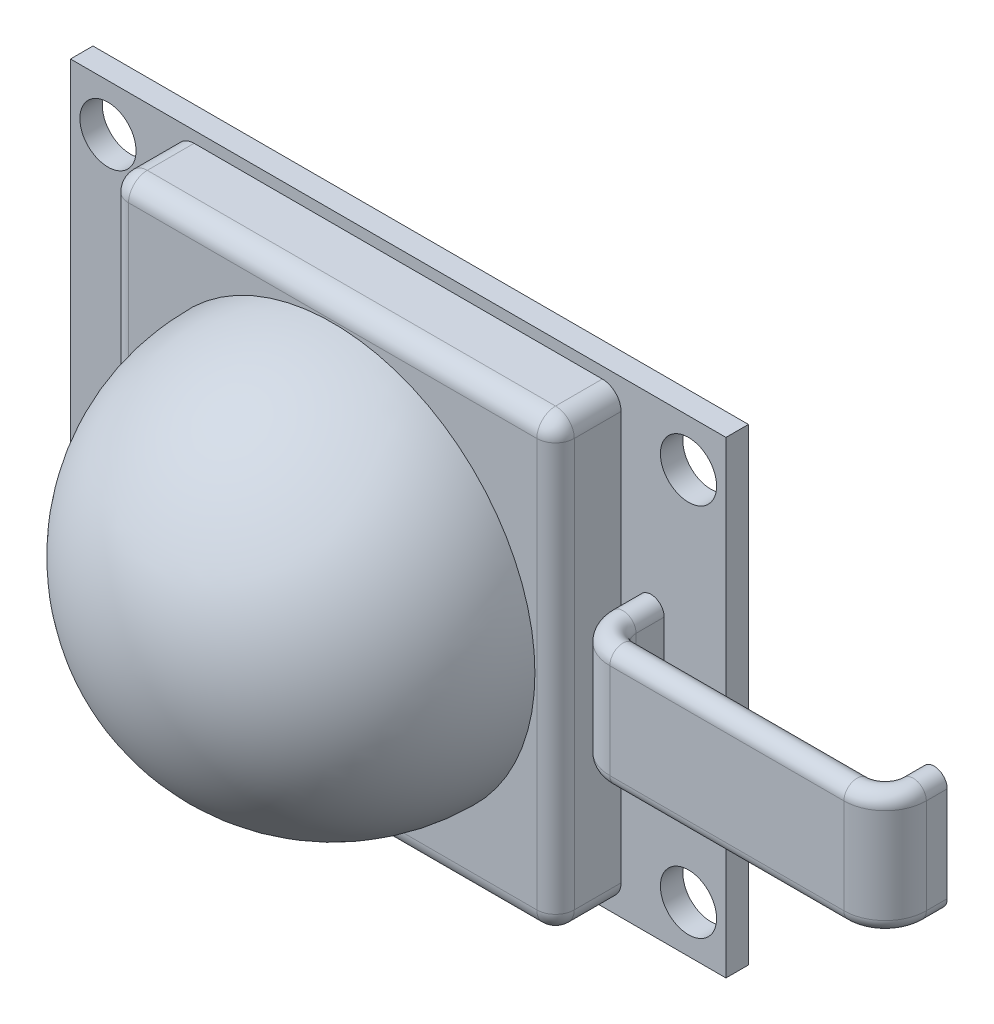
ISO-10303-21;
HEADER;
FILE_DESCRIPTION(('STEP AP214'),'2;1');
FILE_NAME('part.step','',(''),(''),'','','');
FILE_SCHEMA(('AUTOMOTIVE_DESIGN { 1 0 10303 214 1 1 1 1 }'));
ENDSEC;
DATA;
#1=APPLICATION_CONTEXT('core data for automotive mechanical design processes');
#2=APPLICATION_PROTOCOL_DEFINITION('international standard','automotive_design',2000,#1);
#3=PRODUCT_CONTEXT('',#1,'mechanical');
#4=PRODUCT('Part','Part','',(#3));
#5=PRODUCT_RELATED_PRODUCT_CATEGORY('part','',(#4));
#6=PRODUCT_DEFINITION_FORMATION('','',#4);
#7=PRODUCT_DEFINITION_CONTEXT('part definition',#1,'design');
#8=PRODUCT_DEFINITION('design','',#6,#7);
#9=PRODUCT_DEFINITION_SHAPE('','',#8);
#10=(LENGTH_UNIT() NAMED_UNIT(*) SI_UNIT(.MILLI.,.METRE.));
#11=(NAMED_UNIT(*) PLANE_ANGLE_UNIT() SI_UNIT($,.RADIAN.));
#12=(NAMED_UNIT(*) SI_UNIT($,.STERADIAN.) SOLID_ANGLE_UNIT());
#13=UNCERTAINTY_MEASURE_WITH_UNIT(LENGTH_MEASURE(1.E-05),#10,'distance_accuracy_value','');
#14=(GEOMETRIC_REPRESENTATION_CONTEXT(3) GLOBAL_UNCERTAINTY_ASSIGNED_CONTEXT((#13)) GLOBAL_UNIT_ASSIGNED_CONTEXT((#10,
#11,#12)) REPRESENTATION_CONTEXT('',''));
#15=CARTESIAN_POINT('',(0.,0.,0.));
#16=DIRECTION('',(0.,0.,1.));
#17=DIRECTION('',(1.,0.,0.));
#18=AXIS2_PLACEMENT_3D('',#15,#16,#17);
#19=CARTESIAN_POINT('',(0.,25.,1.2));
#20=DIRECTION('',(0.,0.,-1.));
#21=DIRECTION('',(-1.,0.,0.));
#22=AXIS2_PLACEMENT_3D('',#19,#20,#21);
#23=PLANE('',#22);
#24=CARTESIAN_POINT('',(28.4,23.4,1.2));
#25=DIRECTION('',(0.,0.,1.));
#26=DIRECTION('',(-1.,0.,0.));
#27=AXIS2_PLACEMENT_3D('',#24,#25,#26);
#28=CIRCLE('',#27,1.);
#29=CARTESIAN_POINT('',(29.4,23.4,1.2));
#30=VERTEX_POINT('',#29);
#31=CARTESIAN_POINT('',(28.4,24.4,1.2));
#32=VERTEX_POINT('',#31);
#33=EDGE_CURVE('E339',#30,#32,#28,.T.);
#34=ORIENTED_EDGE('',*,*,#33,.F.);
#35=DIRECTION('',(0.,1.,0.));
#36=VECTOR('',#35,1.);
#37=CARTESIAN_POINT('',(29.4,23.4,1.2));
#38=LINE('',#37,#36);
#39=CARTESIAN_POINT('',(29.4,1.60000000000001,1.2));
#40=VERTEX_POINT('',#39);
#41=EDGE_CURVE('E361',#40,#30,#38,.T.);
#42=ORIENTED_EDGE('',*,*,#41,.F.);
#43=CARTESIAN_POINT('',(28.4,1.6,1.2));
#44=DIRECTION('',(0.,0.,1.));
#45=DIRECTION('',(1.,0.,0.));
#46=AXIS2_PLACEMENT_3D('',#43,#44,#45);
#47=CIRCLE('',#46,1.);
#48=CARTESIAN_POINT('',(28.4,0.600000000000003,1.2));
#49=VERTEX_POINT('',#48);
#50=EDGE_CURVE('E358',#49,#40,#47,.T.);
#51=ORIENTED_EDGE('',*,*,#50,.F.);
#52=DIRECTION('',(1.,0.,0.));
#53=VECTOR('',#52,1.);
#54=CARTESIAN_POINT('',(6.60000000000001,0.599999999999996,1.2));
#55=LINE('',#54,#53);
#56=CARTESIAN_POINT('',(6.60000000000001,0.599999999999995,1.2));
#57=VERTEX_POINT('',#56);
#58=EDGE_CURVE('E355',#57,#49,#55,.T.);
#59=ORIENTED_EDGE('',*,*,#58,.F.);
#60=CARTESIAN_POINT('',(6.6,1.6,1.2));
#61=DIRECTION('',(0.,0.,1.));
#62=DIRECTION('',(1.,0.,0.));
#63=AXIS2_PLACEMENT_3D('',#60,#61,#62);
#64=CIRCLE('',#63,1.);
#65=CARTESIAN_POINT('',(5.6,1.6,1.2));
#66=VERTEX_POINT('',#65);
#67=EDGE_CURVE('E352',#66,#57,#64,.T.);
#68=ORIENTED_EDGE('',*,*,#67,.F.);
#69=DIRECTION('',(0.,-1.,0.));
#70=VECTOR('',#69,1.);
#71=CARTESIAN_POINT('',(5.6,23.4,1.2));
#72=LINE('',#71,#70);
#73=CARTESIAN_POINT('',(5.6,23.4,1.2));
#74=VERTEX_POINT('',#73);
#75=EDGE_CURVE('E349',#74,#66,#72,.T.);
#76=ORIENTED_EDGE('',*,*,#75,.F.);
#77=CARTESIAN_POINT('',(6.6,23.4,1.2));
#78=DIRECTION('',(0.,0.,1.));
#79=DIRECTION('',(1.,0.,0.));
#80=AXIS2_PLACEMENT_3D('',#77,#78,#79);
#81=CIRCLE('',#80,1.);
#82=CARTESIAN_POINT('',(6.6,24.4,1.2));
#83=VERTEX_POINT('',#82);
#84=EDGE_CURVE('E346',#83,#74,#81,.T.);
#85=ORIENTED_EDGE('',*,*,#84,.F.);
#86=DIRECTION('',(-1.,0.,0.));
#87=VECTOR('',#86,1.);
#88=CARTESIAN_POINT('',(6.6,24.4,1.2));
#89=LINE('',#88,#87);
#90=EDGE_CURVE('E342',#32,#83,#89,.T.);
#91=ORIENTED_EDGE('',*,*,#90,.F.);
#92=EDGE_LOOP('',(#34,#42,#51,#59,#68,#76,#85,#91));
#93=FACE_BOUND('',#92,.T.);
#94=CARTESIAN_POINT('',(2.,22.5,1.2));
#95=DIRECTION('',(0.,0.,1.));
#96=DIRECTION('',(-1.,0.,0.));
#97=AXIS2_PLACEMENT_3D('',#94,#95,#96);
#98=CIRCLE('',#97,1.5);
#99=CARTESIAN_POINT('',(0.499999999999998,22.5,1.2));
#100=VERTEX_POINT('',#99);
#101=EDGE_CURVE('E397',#100,#100,#98,.T.);
#102=ORIENTED_EDGE('',*,*,#101,.F.);
#103=EDGE_LOOP('',(#102));
#104=FACE_BOUND('',#103,.T.);
#105=CARTESIAN_POINT('',(33.,2.5,1.2));
#106=DIRECTION('',(0.,0.,1.));
#107=DIRECTION('',(-1.,0.,0.));
#108=AXIS2_PLACEMENT_3D('',#105,#106,#107);
#109=CIRCLE('',#108,1.5);
#110=CARTESIAN_POINT('',(31.5,2.5,1.2));
#111=VERTEX_POINT('',#110);
#112=EDGE_CURVE('E409',#111,#111,#109,.T.);
#113=ORIENTED_EDGE('',*,*,#112,.F.);
#114=EDGE_LOOP('',(#113));
#115=FACE_BOUND('',#114,.T.);
#116=DIRECTION('',(0.,-1.,0.));
#117=VECTOR('',#116,1.);
#118=CARTESIAN_POINT('',(0.,0.,1.2));
#119=LINE('',#118,#117);
#120=CARTESIAN_POINT('',(0.,25.,1.2));
#121=VERTEX_POINT('',#120);
#122=CARTESIAN_POINT('',(0.,0.,1.2));
#123=VERTEX_POINT('',#122);
#124=EDGE_CURVE('E421',#121,#123,#119,.T.);
#125=ORIENTED_EDGE('',*,*,#124,.T.);
#126=DIRECTION('',(1.,0.,0.));
#127=VECTOR('',#126,1.);
#128=CARTESIAN_POINT('',(0.,0.,1.2));
#129=LINE('',#128,#127);
#130=CARTESIAN_POINT('',(35.,0.,1.2));
#131=VERTEX_POINT('',#130);
#132=EDGE_CURVE('E424',#123,#131,#129,.T.);
#133=ORIENTED_EDGE('',*,*,#132,.T.);
#134=DIRECTION('',(0.,1.,0.));
#135=VECTOR('',#134,1.);
#136=CARTESIAN_POINT('',(35.,0.,1.2));
#137=LINE('',#136,#135);
#138=CARTESIAN_POINT('',(35.,25.,1.2));
#139=VERTEX_POINT('',#138);
#140=EDGE_CURVE('E427',#131,#139,#137,.T.);
#141=ORIENTED_EDGE('',*,*,#140,.T.);
#142=DIRECTION('',(-1.,0.,0.));
#143=VECTOR('',#142,1.);
#144=CARTESIAN_POINT('',(0.,25.,1.2));
#145=LINE('',#144,#143);
#146=EDGE_CURVE('E429',#139,#121,#145,.T.);
#147=ORIENTED_EDGE('',*,*,#146,.T.);
#148=EDGE_LOOP('',(#125,#133,#141,#147));
#149=FACE_BOUND('',#148,.T.);
#150=CARTESIAN_POINT('',(2.,2.5,1.2));
#151=DIRECTION('',(0.,0.,1.));
#152=DIRECTION('',(1.,0.,0.));
#153=AXIS2_PLACEMENT_3D('',#150,#151,#152);
#154=CIRCLE('',#153,1.5);
#155=CARTESIAN_POINT('',(3.5,2.5,1.2));
#156=VERTEX_POINT('',#155);
#157=EDGE_CURVE('E415',#156,#156,#154,.T.);
#158=ORIENTED_EDGE('',*,*,#157,.F.);
#159=EDGE_LOOP('',(#158));
#160=FACE_BOUND('',#159,.T.);
#161=CARTESIAN_POINT('',(33.,22.5,1.2));
#162=DIRECTION('',(0.,0.,1.));
#163=DIRECTION('',(1.,0.,0.));
#164=AXIS2_PLACEMENT_3D('',#161,#162,#163);
#165=CIRCLE('',#164,1.5);
#166=CARTESIAN_POINT('',(34.5,22.5,1.2));
#167=VERTEX_POINT('',#166);
#168=EDGE_CURVE('E403',#167,#167,#165,.T.);
#169=ORIENTED_EDGE('',*,*,#168,.F.);
#170=EDGE_LOOP('',(#169));
#171=FACE_BOUND('',#170,.T.);
#172=CARTESIAN_POINT('',(31.,15.04,1.2));
#173=DIRECTION('',(0.,0.,1.));
#174=DIRECTION('',(1.,0.,0.));
#175=AXIS2_PLACEMENT_3D('',#172,#173,#174);
#176=CIRCLE('',#175,0.700000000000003);
#177=CARTESIAN_POINT('',(31.7,15.04,1.2));
#178=VERTEX_POINT('',#177);
#179=CARTESIAN_POINT('',(30.3,15.04,1.2));
#180=VERTEX_POINT('',#179);
#181=EDGE_CURVE('E55',#178,#180,#176,.T.);
#182=ORIENTED_EDGE('',*,*,#181,.F.);
#183=DIRECTION('',(0.,1.,0.));
#184=VECTOR('',#183,1.);
#185=CARTESIAN_POINT('',(31.7,15.04,1.2));
#186=LINE('',#185,#184);
#187=CARTESIAN_POINT('',(31.7,9.96,1.2));
#188=VERTEX_POINT('',#187);
#189=EDGE_CURVE('E231',#188,#178,#186,.T.);
#190=ORIENTED_EDGE('',*,*,#189,.F.);
#191=CARTESIAN_POINT('',(31.,9.96,1.2));
#192=DIRECTION('',(0.,0.,1.));
#193=DIRECTION('',(-1.,0.,0.));
#194=AXIS2_PLACEMENT_3D('',#191,#192,#193);
#195=CIRCLE('',#194,0.700000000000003);
#196=CARTESIAN_POINT('',(30.3,9.96,1.2));
#197=VERTEX_POINT('',#196);
#198=EDGE_CURVE('E1147',#197,#188,#195,.T.);
#199=ORIENTED_EDGE('',*,*,#198,.F.);
#200=DIRECTION('',(0.,-1.,0.));
#201=VECTOR('',#200,1.);
#202=CARTESIAN_POINT('',(30.3,15.04,1.2));
#203=LINE('',#202,#201);
#204=EDGE_CURVE('E50',#180,#197,#203,.T.);
#205=ORIENTED_EDGE('',*,*,#204,.F.);
#206=EDGE_LOOP('',(#182,#190,#199,#205));
#207=FACE_BOUND('',#206,.T.);
#208=ADVANCED_FACE('F34',(#93,#104,#115,#149,#160,#171,#207),#23,.F.);
#209=CARTESIAN_POINT('',(28.4,23.4,4.7));
#210=DIRECTION('',(0.,0.,-1.));
#211=DIRECTION('',(-1.,0.,0.));
#212=AXIS2_PLACEMENT_3D('',#209,#210,#211);
#213=PLANE('',#212);
#214=DIRECTION('',(-1.,0.,0.));
#215=VECTOR('',#214,1.);
#216=CARTESIAN_POINT('',(28.4,23.4,4.7));
#217=LINE('',#216,#215);
#218=CARTESIAN_POINT('',(28.4,23.4,4.7));
#219=VERTEX_POINT('',#218);
#220=CARTESIAN_POINT('',(6.6,23.4,4.7));
#221=VERTEX_POINT('',#220);
#222=EDGE_CURVE('E457',#219,#221,#217,.T.);
#223=ORIENTED_EDGE('',*,*,#222,.T.);
#224=DIRECTION('',(0.,-1.,0.));
#225=VECTOR('',#224,1.);
#226=CARTESIAN_POINT('',(6.6,23.4,4.7));
#227=LINE('',#226,#225);
#228=CARTESIAN_POINT('',(6.6,1.6,4.7));
#229=VERTEX_POINT('',#228);
#230=EDGE_CURVE('E459',#221,#229,#227,.T.);
#231=ORIENTED_EDGE('',*,*,#230,.T.);
#232=DIRECTION('',(1.,0.,0.));
#233=VECTOR('',#232,1.);
#234=CARTESIAN_POINT('',(28.4,1.6,4.7));
#235=LINE('',#234,#233);
#236=CARTESIAN_POINT('',(28.4,1.6,4.7));
#237=VERTEX_POINT('',#236);
#238=EDGE_CURVE('E453',#229,#237,#235,.T.);
#239=ORIENTED_EDGE('',*,*,#238,.T.);
#240=DIRECTION('',(0.,1.,0.));
#241=VECTOR('',#240,1.);
#242=CARTESIAN_POINT('',(28.4,23.4,4.7));
#243=LINE('',#242,#241);
#244=EDGE_CURVE('E455',#237,#219,#243,.T.);
#245=ORIENTED_EDGE('',*,*,#244,.T.);
#246=EDGE_LOOP('',(#223,#231,#239,#245));
#247=FACE_BOUND('',#246,.T.);
#248=CARTESIAN_POINT('',(17.5,12.5,4.7));
#249=DIRECTION('',(0.,0.,-1.));
#250=DIRECTION('',(-1.,0.,0.));
#251=AXIS2_PLACEMENT_3D('',#248,#249,#250);
#252=CIRCLE('',#251,10.8001);
#253=CARTESIAN_POINT('',(6.6999,12.5,4.7));
#254=VERTEX_POINT('',#253);
#255=EDGE_CURVE('E11',#254,#254,#252,.F.);
#256=ORIENTED_EDGE('',*,*,#255,.F.);
#257=EDGE_LOOP('',(#256));
#258=FACE_BOUND('',#257,.T.);
#259=ADVANCED_FACE('F567',(#247,#258),#213,.F.);
#260=CARTESIAN_POINT('',(0.,25.,0.));
#261=DIRECTION('',(0.,0.,-1.));
#262=DIRECTION('',(-1.,0.,0.));
#263=AXIS2_PLACEMENT_3D('',#260,#261,#262);
#264=PLANE('',#263);
#265=CARTESIAN_POINT('',(31.,9.96,0.));
#266=DIRECTION('',(0.,0.,1.));
#267=DIRECTION('',(-1.,0.,0.));
#268=AXIS2_PLACEMENT_3D('',#265,#266,#267);
#269=CIRCLE('',#268,0.400000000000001);
#270=CARTESIAN_POINT('',(30.6,9.96,0.));
#271=VERTEX_POINT('',#270);
#272=EDGE_CURVE('E386',#271,#271,#269,.T.);
#273=ORIENTED_EDGE('',*,*,#272,.T.);
#274=EDGE_LOOP('',(#273));
#275=FACE_BOUND('',#274,.T.);
#276=CARTESIAN_POINT('',(2.,22.5,0.));
#277=DIRECTION('',(0.,0.,1.));
#278=DIRECTION('',(-1.,0.,0.));
#279=AXIS2_PLACEMENT_3D('',#276,#277,#278);
#280=CIRCLE('',#279,1.5);
#281=CARTESIAN_POINT('',(0.499999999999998,22.5,0.));
#282=VERTEX_POINT('',#281);
#283=EDGE_CURVE('E396',#282,#282,#280,.T.);
#284=ORIENTED_EDGE('',*,*,#283,.T.);
#285=EDGE_LOOP('',(#284));
#286=FACE_BOUND('',#285,.T.);
#287=CARTESIAN_POINT('',(33.,2.5,0.));
#288=DIRECTION('',(0.,0.,1.));
#289=DIRECTION('',(-1.,0.,0.));
#290=AXIS2_PLACEMENT_3D('',#287,#288,#289);
#291=CIRCLE('',#290,1.5);
#292=CARTESIAN_POINT('',(31.5,2.5,0.));
#293=VERTEX_POINT('',#292);
#294=EDGE_CURVE('E406',#293,#293,#291,.T.);
#295=ORIENTED_EDGE('',*,*,#294,.T.);
#296=EDGE_LOOP('',(#295));
#297=FACE_BOUND('',#296,.T.);
#298=DIRECTION('',(0.,-1.,0.));
#299=VECTOR('',#298,1.);
#300=CARTESIAN_POINT('',(0.,0.,0.));
#301=LINE('',#300,#299);
#302=CARTESIAN_POINT('',(0.,25.,0.));
#303=VERTEX_POINT('',#302);
#304=CARTESIAN_POINT('',(0.,0.,0.));
#305=VERTEX_POINT('',#304);
#306=EDGE_CURVE('E418',#303,#305,#301,.T.);
#307=ORIENTED_EDGE('',*,*,#306,.F.);
#308=DIRECTION('',(-1.,0.,0.));
#309=VECTOR('',#308,1.);
#310=CARTESIAN_POINT('',(0.,25.,0.));
#311=LINE('',#310,#309);
#312=CARTESIAN_POINT('',(35.,25.,0.));
#313=VERTEX_POINT('',#312);
#314=EDGE_CURVE('E425',#313,#303,#311,.T.);
#315=ORIENTED_EDGE('',*,*,#314,.F.);
#316=DIRECTION('',(0.,1.,0.));
#317=VECTOR('',#316,1.);
#318=CARTESIAN_POINT('',(35.,0.,0.));
#319=LINE('',#318,#317);
#320=CARTESIAN_POINT('',(35.,0.,0.));
#321=VERTEX_POINT('',#320);
#322=EDGE_CURVE('E436',#321,#313,#319,.T.);
#323=ORIENTED_EDGE('',*,*,#322,.F.);
#324=DIRECTION('',(1.,0.,0.));
#325=VECTOR('',#324,1.);
#326=CARTESIAN_POINT('',(0.,0.,0.));
#327=LINE('',#326,#325);
#328=EDGE_CURVE('E434',#305,#321,#327,.T.);
#329=ORIENTED_EDGE('',*,*,#328,.F.);
#330=EDGE_LOOP('',(#307,#315,#323,#329));
#331=FACE_BOUND('',#330,.T.);
#332=CARTESIAN_POINT('',(2.,2.5,0.));
#333=DIRECTION('',(0.,0.,1.));
#334=DIRECTION('',(1.,0.,0.));
#335=AXIS2_PLACEMENT_3D('',#332,#333,#334);
#336=CIRCLE('',#335,1.5);
#337=CARTESIAN_POINT('',(3.5,2.5,0.));
#338=VERTEX_POINT('',#337);
#339=EDGE_CURVE('E412',#338,#338,#336,.T.);
#340=ORIENTED_EDGE('',*,*,#339,.T.);
#341=EDGE_LOOP('',(#340));
#342=FACE_BOUND('',#341,.T.);
#343=CARTESIAN_POINT('',(33.,22.5,0.));
#344=DIRECTION('',(0.,0.,1.));
#345=DIRECTION('',(1.,0.,0.));
#346=AXIS2_PLACEMENT_3D('',#343,#344,#345);
#347=CIRCLE('',#346,1.5);
#348=CARTESIAN_POINT('',(34.5,22.5,0.));
#349=VERTEX_POINT('',#348);
#350=EDGE_CURVE('E400',#349,#349,#347,.T.);
#351=ORIENTED_EDGE('',*,*,#350,.T.);
#352=EDGE_LOOP('',(#351));
#353=FACE_BOUND('',#352,.T.);
#354=CARTESIAN_POINT('',(31.,12.5,0.));
#355=DIRECTION('',(0.,0.,1.));
#356=DIRECTION('',(1.,0.,0.));
#357=AXIS2_PLACEMENT_3D('',#354,#355,#356);
#358=CIRCLE('',#357,0.399999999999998);
#359=CARTESIAN_POINT('',(31.4,12.5,0.));
#360=VERTEX_POINT('',#359);
#361=EDGE_CURVE('E391',#360,#360,#358,.T.);
#362=ORIENTED_EDGE('',*,*,#361,.T.);
#363=EDGE_LOOP('',(#362));
#364=FACE_BOUND('',#363,.T.);
#365=CARTESIAN_POINT('',(31.,15.04,0.));
#366=DIRECTION('',(0.,0.,1.));
#367=DIRECTION('',(1.,0.,0.));
#368=AXIS2_PLACEMENT_3D('',#365,#366,#367);
#369=CIRCLE('',#368,0.400000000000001);
#370=CARTESIAN_POINT('',(31.4,15.04,0.));
#371=VERTEX_POINT('',#370);
#372=EDGE_CURVE('E380',#371,#371,#369,.T.);
#373=ORIENTED_EDGE('',*,*,#372,.T.);
#374=EDGE_LOOP('',(#373));
#375=FACE_BOUND('',#374,.T.);
#376=ADVANCED_FACE('F574',(#275,#286,#297,#331,#342,#353,#364,#375),#264,.T.);
#377=CARTESIAN_POINT('',(0.,0.,1.2));
#378=DIRECTION('',(1.,0.,0.));
#379=DIRECTION('',(0.,0.,-1.));
#380=AXIS2_PLACEMENT_3D('',#377,#378,#379);
#381=PLANE('',#380);
#382=ORIENTED_EDGE('',*,*,#306,.T.);
#383=DIRECTION('',(0.,0.,-1.));
#384=VECTOR('',#383,1.);
#385=CARTESIAN_POINT('',(0.,0.,1.2));
#386=LINE('',#385,#384);
#387=EDGE_CURVE('E447',#123,#305,#386,.T.);
#388=ORIENTED_EDGE('',*,*,#387,.F.);
#389=ORIENTED_EDGE('',*,*,#124,.F.);
#390=DIRECTION('',(0.,0.,-1.));
#391=VECTOR('',#390,1.);
#392=CARTESIAN_POINT('',(0.,25.,1.2));
#393=LINE('',#392,#391);
#394=EDGE_CURVE('E431',#121,#303,#393,.T.);
#395=ORIENTED_EDGE('',*,*,#394,.T.);
#396=EDGE_LOOP('',(#382,#388,#389,#395));
#397=FACE_BOUND('',#396,.T.);
#398=ADVANCED_FACE('F584',(#397),#381,.F.);
#399=CARTESIAN_POINT('',(0.,0.,1.2));
#400=DIRECTION('',(0.,1.,0.));
#401=DIRECTION('',(0.,0.,1.));
#402=AXIS2_PLACEMENT_3D('',#399,#400,#401);
#403=PLANE('',#402);
#404=ORIENTED_EDGE('',*,*,#328,.T.);
#405=DIRECTION('',(0.,0.,-1.));
#406=VECTOR('',#405,1.);
#407=CARTESIAN_POINT('',(35.,0.,1.2));
#408=LINE('',#407,#406);
#409=EDGE_CURVE('E444',#131,#321,#408,.T.);
#410=ORIENTED_EDGE('',*,*,#409,.F.);
#411=ORIENTED_EDGE('',*,*,#132,.F.);
#412=ORIENTED_EDGE('',*,*,#387,.T.);
#413=EDGE_LOOP('',(#404,#410,#411,#412));
#414=FACE_BOUND('',#413,.T.);
#415=ADVANCED_FACE('F593',(#414),#403,.F.);
#416=CARTESIAN_POINT('',(35.,0.,1.2));
#417=DIRECTION('',(-1.,0.,0.));
#418=DIRECTION('',(0.,0.,1.));
#419=AXIS2_PLACEMENT_3D('',#416,#417,#418);
#420=PLANE('',#419);
#421=ORIENTED_EDGE('',*,*,#322,.T.);
#422=DIRECTION('',(0.,0.,-1.));
#423=VECTOR('',#422,1.);
#424=CARTESIAN_POINT('',(35.,25.,1.2));
#425=LINE('',#424,#423);
#426=EDGE_CURVE('E441',#139,#313,#425,.T.);
#427=ORIENTED_EDGE('',*,*,#426,.F.);
#428=ORIENTED_EDGE('',*,*,#140,.F.);
#429=ORIENTED_EDGE('',*,*,#409,.T.);
#430=EDGE_LOOP('',(#421,#427,#428,#429));
#431=FACE_BOUND('',#430,.T.);
#432=ADVANCED_FACE('F589',(#431),#420,.F.);
#433=CARTESIAN_POINT('',(0.,25.,1.2));
#434=DIRECTION('',(0.,-1.,0.));
#435=DIRECTION('',(0.,0.,-1.));
#436=AXIS2_PLACEMENT_3D('',#433,#434,#435);
#437=PLANE('',#436);
#438=ORIENTED_EDGE('',*,*,#314,.T.);
#439=ORIENTED_EDGE('',*,*,#394,.F.);
#440=ORIENTED_EDGE('',*,*,#146,.F.);
#441=ORIENTED_EDGE('',*,*,#426,.T.);
#442=EDGE_LOOP('',(#438,#439,#440,#441));
#443=FACE_BOUND('',#442,.T.);
#444=ADVANCED_FACE('F586',(#443),#437,.F.);
#445=CARTESIAN_POINT('',(2.,2.5,1.2));
#446=DIRECTION('',(0.,0.,-1.));
#447=DIRECTION('',(-1.,0.,0.));
#448=AXIS2_PLACEMENT_3D('',#445,#446,#447);
#449=CYLINDRICAL_SURFACE('',#448,1.5);
#450=ORIENTED_EDGE('',*,*,#157,.T.);
#451=EDGE_LOOP('',(#450));
#452=FACE_BOUND('',#451,.T.);
#453=ORIENTED_EDGE('',*,*,#339,.F.);
#454=EDGE_LOOP('',(#453));
#455=FACE_BOUND('',#454,.T.);
#456=ADVANCED_FACE('F580',(#452,#455),#449,.F.);
#457=CARTESIAN_POINT('',(33.,2.5,1.2));
#458=DIRECTION('',(0.,0.,-1.));
#459=DIRECTION('',(-1.,0.,0.));
#460=AXIS2_PLACEMENT_3D('',#457,#458,#459);
#461=CYLINDRICAL_SURFACE('',#460,1.5);
#462=ORIENTED_EDGE('',*,*,#112,.T.);
#463=EDGE_LOOP('',(#462));
#464=FACE_BOUND('',#463,.T.);
#465=ORIENTED_EDGE('',*,*,#294,.F.);
#466=EDGE_LOOP('',(#465));
#467=FACE_BOUND('',#466,.T.);
#468=ADVANCED_FACE('F993',(#464,#467),#461,.F.);
#469=CARTESIAN_POINT('',(33.,22.5,1.2));
#470=DIRECTION('',(0.,0.,-1.));
#471=DIRECTION('',(-1.,0.,0.));
#472=AXIS2_PLACEMENT_3D('',#469,#470,#471);
#473=CYLINDRICAL_SURFACE('',#472,1.5);
#474=ORIENTED_EDGE('',*,*,#168,.T.);
#475=EDGE_LOOP('',(#474));
#476=FACE_BOUND('',#475,.T.);
#477=ORIENTED_EDGE('',*,*,#350,.F.);
#478=EDGE_LOOP('',(#477));
#479=FACE_BOUND('',#478,.T.);
#480=ADVANCED_FACE('F990',(#476,#479),#473,.F.);
#481=CARTESIAN_POINT('',(2.,22.5,1.2));
#482=DIRECTION('',(0.,0.,-1.));
#483=DIRECTION('',(-1.,0.,0.));
#484=AXIS2_PLACEMENT_3D('',#481,#482,#483);
#485=CYLINDRICAL_SURFACE('',#484,1.5);
#486=ORIENTED_EDGE('',*,*,#101,.T.);
#487=EDGE_LOOP('',(#486));
#488=FACE_BOUND('',#487,.T.);
#489=ORIENTED_EDGE('',*,*,#283,.F.);
#490=EDGE_LOOP('',(#489));
#491=FACE_BOUND('',#490,.T.);
#492=ADVANCED_FACE('F986',(#488,#491),#485,.F.);
#493=CARTESIAN_POINT('',(31.,12.5,1.2));
#494=DIRECTION('',(0.,0.,-1.));
#495=DIRECTION('',(-1.,0.,0.));
#496=AXIS2_PLACEMENT_3D('',#493,#494,#495);
#497=CYLINDRICAL_SURFACE('',#496,0.399999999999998);
#498=CARTESIAN_POINT('',(31.,12.5,1.2));
#499=DIRECTION('',(0.,0.,1.));
#500=DIRECTION('',(1.,0.,0.));
#501=AXIS2_PLACEMENT_3D('',#498,#499,#500);
#502=CIRCLE('',#501,0.399999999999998);
#503=CARTESIAN_POINT('',(31.4,12.5,1.2));
#504=VERTEX_POINT('',#503);
#505=EDGE_CURVE('E383',#504,#504,#502,.T.);
#506=ORIENTED_EDGE('',*,*,#505,.T.);
#507=EDGE_LOOP('',(#506));
#508=FACE_BOUND('',#507,.T.);
#509=ORIENTED_EDGE('',*,*,#361,.F.);
#510=EDGE_LOOP('',(#509));
#511=FACE_BOUND('',#510,.T.);
#512=ADVANCED_FACE('F980',(#508,#511),#497,.F.);
#513=CARTESIAN_POINT('',(31.,9.96,1.2));
#514=DIRECTION('',(0.,0.,-1.));
#515=DIRECTION('',(-1.,0.,0.));
#516=AXIS2_PLACEMENT_3D('',#513,#514,#515);
#517=CYLINDRICAL_SURFACE('',#516,0.400000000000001);
#518=CARTESIAN_POINT('',(31.,9.96,1.2));
#519=DIRECTION('',(0.,0.,1.));
#520=DIRECTION('',(-1.,0.,0.));
#521=AXIS2_PLACEMENT_3D('',#518,#519,#520);
#522=CIRCLE('',#521,0.400000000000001);
#523=CARTESIAN_POINT('',(30.6,9.96,1.2));
#524=VERTEX_POINT('',#523);
#525=EDGE_CURVE('E333',#524,#524,#522,.T.);
#526=ORIENTED_EDGE('',*,*,#525,.T.);
#527=EDGE_LOOP('',(#526));
#528=FACE_BOUND('',#527,.T.);
#529=ORIENTED_EDGE('',*,*,#272,.F.);
#530=EDGE_LOOP('',(#529));
#531=FACE_BOUND('',#530,.T.);
#532=ADVANCED_FACE('F973',(#528,#531),#517,.F.);
#533=CARTESIAN_POINT('',(31.,15.04,1.2));
#534=DIRECTION('',(0.,0.,-1.));
#535=DIRECTION('',(-1.,0.,0.));
#536=AXIS2_PLACEMENT_3D('',#533,#534,#535);
#537=CYLINDRICAL_SURFACE('',#536,0.400000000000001);
#538=CARTESIAN_POINT('',(31.,15.04,1.2));
#539=DIRECTION('',(0.,0.,1.));
#540=DIRECTION('',(1.,0.,0.));
#541=AXIS2_PLACEMENT_3D('',#538,#539,#540);
#542=CIRCLE('',#541,0.400000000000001);
#543=CARTESIAN_POINT('',(31.4,15.04,1.2));
#544=VERTEX_POINT('',#543);
#545=EDGE_CURVE('E338',#544,#544,#542,.T.);
#546=ORIENTED_EDGE('',*,*,#545,.T.);
#547=EDGE_LOOP('',(#546));
#548=FACE_BOUND('',#547,.T.);
#549=ORIENTED_EDGE('',*,*,#372,.F.);
#550=EDGE_LOOP('',(#549));
#551=FACE_BOUND('',#550,.T.);
#552=ADVANCED_FACE('F564',(#548,#551),#537,.F.);
#553=CARTESIAN_POINT('',(28.4,23.4,4.7));
#554=DIRECTION('',(0.,0.,-1.));
#555=DIRECTION('',(-1.,0.,0.));
#556=AXIS2_PLACEMENT_3D('',#553,#554,#555);
#557=CYLINDRICAL_SURFACE('',#556,1.);
#558=DIRECTION('',(0.,0.,-1.));
#559=VECTOR('',#558,1.);
#560=CARTESIAN_POINT('',(28.4,24.4,4.7));
#561=LINE('',#560,#559);
#562=CARTESIAN_POINT('',(28.4,24.4,3.7));
#563=VERTEX_POINT('',#562);
#564=EDGE_CURVE('E378',#563,#32,#561,.T.);
#565=ORIENTED_EDGE('',*,*,#564,.F.);
#566=CARTESIAN_POINT('',(28.4,23.4,3.7));
#567=DIRECTION('',(0.,0.,-1.));
#568=DIRECTION('',(-1.,0.,0.));
#569=AXIS2_PLACEMENT_3D('',#566,#567,#568);
#570=CIRCLE('',#569,1.);
#571=CARTESIAN_POINT('',(29.4,23.4,3.7));
#572=VERTEX_POINT('',#571);
#573=EDGE_CURVE('E468',#563,#572,#570,.T.);
#574=ORIENTED_EDGE('',*,*,#573,.T.);
#575=DIRECTION('',(0.,0.,-1.));
#576=VECTOR('',#575,1.);
#577=CARTESIAN_POINT('',(29.4,23.4,4.7));
#578=LINE('',#577,#576);
#579=EDGE_CURVE('E364',#572,#30,#578,.T.);
#580=ORIENTED_EDGE('',*,*,#579,.T.);
#581=ORIENTED_EDGE('',*,*,#33,.T.);
#582=EDGE_LOOP('',(#565,#574,#580,#581));
#583=FACE_BOUND('',#582,.T.);
#584=ADVANCED_FACE('F506',(#583),#557,.T.);
#585=CARTESIAN_POINT('',(6.6,24.4,4.7));
#586=DIRECTION('',(0.,-1.,0.));
#587=DIRECTION('',(1.,0.,0.));
#588=AXIS2_PLACEMENT_3D('',#585,#586,#587);
#589=PLANE('',#588);
#590=DIRECTION('',(0.,0.,-1.));
#591=VECTOR('',#590,1.);
#592=CARTESIAN_POINT('',(6.6,24.4,4.7));
#593=LINE('',#592,#591);
#594=CARTESIAN_POINT('',(6.6,24.4,3.7));
#595=VERTEX_POINT('',#594);
#596=EDGE_CURVE('E376',#595,#83,#593,.T.);
#597=ORIENTED_EDGE('',*,*,#596,.F.);
#598=DIRECTION('',(-1.,0.,0.));
#599=VECTOR('',#598,1.);
#600=CARTESIAN_POINT('',(6.6,24.4,3.7));
#601=LINE('',#600,#599);
#602=EDGE_CURVE('E466',#595,#563,#601,.F.);
#603=ORIENTED_EDGE('',*,*,#602,.T.);
#604=ORIENTED_EDGE('',*,*,#564,.T.);
#605=ORIENTED_EDGE('',*,*,#90,.T.);
#606=EDGE_LOOP('',(#597,#603,#604,#605));
#607=FACE_BOUND('',#606,.T.);
#608=ADVANCED_FACE('F556',(#607),#589,.F.);
#609=CARTESIAN_POINT('',(6.6,23.4,4.7));
#610=DIRECTION('',(0.,0.,-1.));
#611=DIRECTION('',(-1.,0.,0.));
#612=AXIS2_PLACEMENT_3D('',#609,#610,#611);
#613=CYLINDRICAL_SURFACE('',#612,1.);
#614=DIRECTION('',(0.,0.,-1.));
#615=VECTOR('',#614,1.);
#616=CARTESIAN_POINT('',(5.6,23.4,4.7));
#617=LINE('',#616,#615);
#618=CARTESIAN_POINT('',(5.6,23.4,3.7));
#619=VERTEX_POINT('',#618);
#620=EDGE_CURVE('E374',#619,#74,#617,.T.);
#621=ORIENTED_EDGE('',*,*,#620,.F.);
#622=CARTESIAN_POINT('',(6.6,23.4,3.7));
#623=DIRECTION('',(0.,0.,-1.));
#624=DIRECTION('',(-1.,0.,0.));
#625=AXIS2_PLACEMENT_3D('',#622,#623,#624);
#626=CIRCLE('',#625,1.);
#627=EDGE_CURVE('E464',#619,#595,#626,.T.);
#628=ORIENTED_EDGE('',*,*,#627,.T.);
#629=ORIENTED_EDGE('',*,*,#596,.T.);
#630=ORIENTED_EDGE('',*,*,#84,.T.);
#631=EDGE_LOOP('',(#621,#628,#629,#630));
#632=FACE_BOUND('',#631,.T.);
#633=ADVANCED_FACE('F552',(#632),#613,.T.);
#634=CARTESIAN_POINT('',(5.6,23.4,4.7));
#635=DIRECTION('',(1.,0.,0.));
#636=DIRECTION('',(0.,1.,0.));
#637=AXIS2_PLACEMENT_3D('',#634,#635,#636);
#638=PLANE('',#637);
#639=DIRECTION('',(0.,0.,-1.));
#640=VECTOR('',#639,1.);
#641=CARTESIAN_POINT('',(5.6,1.6,4.7));
#642=LINE('',#641,#640);
#643=CARTESIAN_POINT('',(5.6,1.6,3.7));
#644=VERTEX_POINT('',#643);
#645=EDGE_CURVE('E372',#644,#66,#642,.T.);
#646=ORIENTED_EDGE('',*,*,#645,.F.);
#647=DIRECTION('',(0.,-1.,0.));
#648=VECTOR('',#647,1.);
#649=CARTESIAN_POINT('',(5.6,23.4,3.7));
#650=LINE('',#649,#648);
#651=EDGE_CURVE('E462',#644,#619,#650,.F.);
#652=ORIENTED_EDGE('',*,*,#651,.T.);
#653=ORIENTED_EDGE('',*,*,#620,.T.);
#654=ORIENTED_EDGE('',*,*,#75,.T.);
#655=EDGE_LOOP('',(#646,#652,#653,#654));
#656=FACE_BOUND('',#655,.T.);
#657=ADVANCED_FACE('F548',(#656),#638,.F.);
#658=CARTESIAN_POINT('',(6.6,1.6,4.7));
#659=DIRECTION('',(0.,0.,-1.));
#660=DIRECTION('',(-1.,0.,0.));
#661=AXIS2_PLACEMENT_3D('',#658,#659,#660);
#662=CYLINDRICAL_SURFACE('',#661,1.);
#663=DIRECTION('',(0.,0.,-1.));
#664=VECTOR('',#663,1.);
#665=CARTESIAN_POINT('',(6.60000000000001,0.599999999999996,4.7));
#666=LINE('',#665,#664);
#667=CARTESIAN_POINT('',(6.60000000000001,0.599999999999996,3.7));
#668=VERTEX_POINT('',#667);
#669=EDGE_CURVE('E370',#668,#57,#666,.T.);
#670=ORIENTED_EDGE('',*,*,#669,.F.);
#671=CARTESIAN_POINT('',(6.6,1.6,3.7));
#672=DIRECTION('',(0.,0.,-1.));
#673=DIRECTION('',(-1.,0.,0.));
#674=AXIS2_PLACEMENT_3D('',#671,#672,#673);
#675=CIRCLE('',#674,1.);
#676=EDGE_CURVE('E450',#668,#644,#675,.T.);
#677=ORIENTED_EDGE('',*,*,#676,.T.);
#678=ORIENTED_EDGE('',*,*,#645,.T.);
#679=ORIENTED_EDGE('',*,*,#67,.T.);
#680=EDGE_LOOP('',(#670,#677,#678,#679));
#681=FACE_BOUND('',#680,.T.);
#682=ADVANCED_FACE('F546',(#681),#662,.T.);
#683=CARTESIAN_POINT('',(6.60000000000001,0.599999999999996,4.7));
#684=DIRECTION('',(0.,1.,0.));
#685=DIRECTION('',(-1.,0.,0.));
#686=AXIS2_PLACEMENT_3D('',#683,#684,#685);
#687=PLANE('',#686);
#688=DIRECTION('',(0.,0.,-1.));
#689=VECTOR('',#688,1.);
#690=CARTESIAN_POINT('',(28.4,0.600000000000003,4.7));
#691=LINE('',#690,#689);
#692=CARTESIAN_POINT('',(28.4,0.600000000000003,3.7));
#693=VERTEX_POINT('',#692);
#694=EDGE_CURVE('E368',#693,#49,#691,.T.);
#695=ORIENTED_EDGE('',*,*,#694,.F.);
#696=DIRECTION('',(1.,0.,0.));
#697=VECTOR('',#696,1.);
#698=CARTESIAN_POINT('',(6.60000000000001,0.599999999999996,3.7));
#699=LINE('',#698,#697);
#700=EDGE_CURVE('E43',#693,#668,#699,.F.);
#701=ORIENTED_EDGE('',*,*,#700,.T.);
#702=ORIENTED_EDGE('',*,*,#669,.T.);
#703=ORIENTED_EDGE('',*,*,#58,.T.);
#704=EDGE_LOOP('',(#695,#701,#702,#703));
#705=FACE_BOUND('',#704,.T.);
#706=ADVANCED_FACE('F524',(#705),#687,.F.);
#707=CARTESIAN_POINT('',(28.4,1.6,4.7));
#708=DIRECTION('',(0.,0.,-1.));
#709=DIRECTION('',(-1.,0.,0.));
#710=AXIS2_PLACEMENT_3D('',#707,#708,#709);
#711=CYLINDRICAL_SURFACE('',#710,1.);
#712=DIRECTION('',(0.,0.,-1.));
#713=VECTOR('',#712,1.);
#714=CARTESIAN_POINT('',(29.4,1.60000000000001,4.7));
#715=LINE('',#714,#713);
#716=CARTESIAN_POINT('',(29.4,1.60000000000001,3.7));
#717=VERTEX_POINT('',#716);
#718=EDGE_CURVE('E366',#717,#40,#715,.T.);
#719=ORIENTED_EDGE('',*,*,#718,.F.);
#720=CARTESIAN_POINT('',(28.4,1.6,3.7));
#721=DIRECTION('',(0.,0.,-1.));
#722=DIRECTION('',(-1.,0.,0.));
#723=AXIS2_PLACEMENT_3D('',#720,#721,#722);
#724=CIRCLE('',#723,1.);
#725=EDGE_CURVE('E472',#717,#693,#724,.T.);
#726=ORIENTED_EDGE('',*,*,#725,.T.);
#727=ORIENTED_EDGE('',*,*,#694,.T.);
#728=ORIENTED_EDGE('',*,*,#50,.T.);
#729=EDGE_LOOP('',(#719,#726,#727,#728));
#730=FACE_BOUND('',#729,.T.);
#731=ADVANCED_FACE('F518',(#730),#711,.T.);
#732=CARTESIAN_POINT('',(29.4,23.4,4.7));
#733=DIRECTION('',(-1.,0.,0.));
#734=DIRECTION('',(0.,0.,1.));
#735=AXIS2_PLACEMENT_3D('',#732,#733,#734);
#736=PLANE('',#735);
#737=ORIENTED_EDGE('',*,*,#579,.F.);
#738=DIRECTION('',(0.,1.,0.));
#739=VECTOR('',#738,1.);
#740=CARTESIAN_POINT('',(29.4,23.4,3.7));
#741=LINE('',#740,#739);
#742=EDGE_CURVE('E470',#572,#717,#741,.F.);
#743=ORIENTED_EDGE('',*,*,#742,.T.);
#744=ORIENTED_EDGE('',*,*,#718,.T.);
#745=ORIENTED_EDGE('',*,*,#41,.T.);
#746=EDGE_LOOP('',(#737,#743,#744,#745));
#747=FACE_BOUND('',#746,.T.);
#748=ADVANCED_FACE('F509',(#747),#736,.F.);
#749=CARTESIAN_POINT('',(28.4,23.4,3.7));
#750=DIRECTION('',(0.,0.,1.));
#751=DIRECTION('',(1.,0.,0.));
#752=AXIS2_PLACEMENT_3D('',#749,#750,#751);
#753=SPHERICAL_SURFACE('',#752,1.);
#754=CARTESIAN_POINT('',(28.4,23.4,3.7));
#755=DIRECTION('',(0.,-1.,0.));
#756=DIRECTION('',(1.,0.,0.));
#757=AXIS2_PLACEMENT_3D('',#754,#755,#756);
#758=CIRCLE('',#757,1.);
#759=EDGE_CURVE('E490',#572,#219,#758,.T.);
#760=ORIENTED_EDGE('',*,*,#759,.F.);
#761=ORIENTED_EDGE('',*,*,#573,.F.);
#762=CARTESIAN_POINT('',(28.4,23.4,3.7));
#763=DIRECTION('',(-1.,0.,0.));
#764=DIRECTION('',(0.,-1.,0.));
#765=AXIS2_PLACEMENT_3D('',#762,#763,#764);
#766=CIRCLE('',#765,1.);
#767=EDGE_CURVE('E343',#219,#563,#766,.T.);
#768=ORIENTED_EDGE('',*,*,#767,.F.);
#769=EDGE_LOOP('',(#760,#761,#768));
#770=FACE_BOUND('',#769,.T.);
#771=ADVANCED_FACE('F36',(#770),#753,.T.);
#772=CARTESIAN_POINT('',(28.4,23.4,3.7));
#773=DIRECTION('',(-1.,0.,0.));
#774=DIRECTION('',(0.,-1.,0.));
#775=AXIS2_PLACEMENT_3D('',#772,#773,#774);
#776=CYLINDRICAL_SURFACE('',#775,1.);
#777=ORIENTED_EDGE('',*,*,#767,.T.);
#778=ORIENTED_EDGE('',*,*,#602,.F.);
#779=CARTESIAN_POINT('',(6.6,23.4,3.7));
#780=DIRECTION('',(-1.,0.,0.));
#781=DIRECTION('',(0.,-1.,0.));
#782=AXIS2_PLACEMENT_3D('',#779,#780,#781);
#783=CIRCLE('',#782,1.);
#784=EDGE_CURVE('E487',#221,#595,#783,.T.);
#785=ORIENTED_EDGE('',*,*,#784,.F.);
#786=ORIENTED_EDGE('',*,*,#222,.F.);
#787=EDGE_LOOP('',(#777,#778,#785,#786));
#788=FACE_BOUND('',#787,.T.);
#789=ADVANCED_FACE('F497',(#788),#776,.T.);
#790=CARTESIAN_POINT('',(28.4,23.4,3.7));
#791=DIRECTION('',(0.,1.,0.));
#792=DIRECTION('',(0.,0.,1.));
#793=AXIS2_PLACEMENT_3D('',#790,#791,#792);
#794=CYLINDRICAL_SURFACE('',#793,1.);
#795=ORIENTED_EDGE('',*,*,#759,.T.);
#796=ORIENTED_EDGE('',*,*,#244,.F.);
#797=CARTESIAN_POINT('',(28.4,1.60000000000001,3.7));
#798=DIRECTION('',(0.,-1.,0.));
#799=DIRECTION('',(0.,0.,-1.));
#800=AXIS2_PLACEMENT_3D('',#797,#798,#799);
#801=CIRCLE('',#800,1.);
#802=EDGE_CURVE('E484',#717,#237,#801,.T.);
#803=ORIENTED_EDGE('',*,*,#802,.F.);
#804=ORIENTED_EDGE('',*,*,#742,.F.);
#805=EDGE_LOOP('',(#795,#796,#803,#804));
#806=FACE_BOUND('',#805,.T.);
#807=ADVANCED_FACE('F613',(#806),#794,.T.);
#808=CARTESIAN_POINT('',(6.6,23.4,3.7));
#809=DIRECTION('',(0.,0.,1.));
#810=DIRECTION('',(1.,0.,0.));
#811=AXIS2_PLACEMENT_3D('',#808,#809,#810);
#812=SPHERICAL_SURFACE('',#811,1.);
#813=ORIENTED_EDGE('',*,*,#784,.T.);
#814=ORIENTED_EDGE('',*,*,#627,.F.);
#815=CARTESIAN_POINT('',(6.6,23.4,3.7));
#816=DIRECTION('',(0.,-1.,0.));
#817=DIRECTION('',(1.,0.,0.));
#818=AXIS2_PLACEMENT_3D('',#815,#816,#817);
#819=CIRCLE('',#818,1.);
#820=EDGE_CURVE('E481',#221,#619,#819,.T.);
#821=ORIENTED_EDGE('',*,*,#820,.F.);
#822=EDGE_LOOP('',(#813,#814,#821));
#823=FACE_BOUND('',#822,.T.);
#824=ADVANCED_FACE('F610',(#823),#812,.T.);
#825=CARTESIAN_POINT('',(28.4,1.6,3.7));
#826=DIRECTION('',(0.,0.,1.));
#827=DIRECTION('',(1.,0.,0.));
#828=AXIS2_PLACEMENT_3D('',#825,#826,#827);
#829=SPHERICAL_SURFACE('',#828,1.);
#830=ORIENTED_EDGE('',*,*,#725,.F.);
#831=ORIENTED_EDGE('',*,*,#802,.T.);
#832=CARTESIAN_POINT('',(28.4,1.6,3.7));
#833=DIRECTION('',(-1.,0.,0.));
#834=DIRECTION('',(0.,-1.,0.));
#835=AXIS2_PLACEMENT_3D('',#832,#833,#834);
#836=CIRCLE('',#835,1.);
#837=EDGE_CURVE('E478',#693,#237,#836,.T.);
#838=ORIENTED_EDGE('',*,*,#837,.F.);
#839=EDGE_LOOP('',(#830,#831,#838));
#840=FACE_BOUND('',#839,.T.);
#841=ADVANCED_FACE('F528',(#840),#829,.T.);
#842=CARTESIAN_POINT('',(6.6,23.4,3.7));
#843=DIRECTION('',(0.,-1.,0.));
#844=DIRECTION('',(1.,0.,0.));
#845=AXIS2_PLACEMENT_3D('',#842,#843,#844);
#846=CYLINDRICAL_SURFACE('',#845,1.);
#847=ORIENTED_EDGE('',*,*,#820,.T.);
#848=ORIENTED_EDGE('',*,*,#651,.F.);
#849=CARTESIAN_POINT('',(6.6,1.6,3.7));
#850=DIRECTION('',(0.,-1.,0.));
#851=DIRECTION('',(1.,0.,0.));
#852=AXIS2_PLACEMENT_3D('',#849,#850,#851);
#853=CIRCLE('',#852,1.);
#854=EDGE_CURVE('E476',#229,#644,#853,.T.);
#855=ORIENTED_EDGE('',*,*,#854,.F.);
#856=ORIENTED_EDGE('',*,*,#230,.F.);
#857=EDGE_LOOP('',(#847,#848,#855,#856));
#858=FACE_BOUND('',#857,.T.);
#859=ADVANCED_FACE('F540',(#858),#846,.T.);
#860=CARTESIAN_POINT('',(28.4,1.6,3.7));
#861=DIRECTION('',(1.,0.,0.));
#862=DIRECTION('',(0.,1.,0.));
#863=AXIS2_PLACEMENT_3D('',#860,#861,#862);
#864=CYLINDRICAL_SURFACE('',#863,1.);
#865=ORIENTED_EDGE('',*,*,#837,.T.);
#866=ORIENTED_EDGE('',*,*,#238,.F.);
#867=CARTESIAN_POINT('',(6.60000000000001,1.6,3.7));
#868=DIRECTION('',(-1.,0.,0.));
#869=DIRECTION('',(0.,0.,1.));
#870=AXIS2_PLACEMENT_3D('',#867,#868,#869);
#871=CIRCLE('',#870,1.);
#872=EDGE_CURVE('E337',#668,#229,#871,.T.);
#873=ORIENTED_EDGE('',*,*,#872,.F.);
#874=ORIENTED_EDGE('',*,*,#700,.F.);
#875=EDGE_LOOP('',(#865,#866,#873,#874));
#876=FACE_BOUND('',#875,.T.);
#877=ADVANCED_FACE('F532',(#876),#864,.T.);
#878=CARTESIAN_POINT('',(6.6,1.6,3.7));
#879=DIRECTION('',(0.,0.,1.));
#880=DIRECTION('',(1.,0.,0.));
#881=AXIS2_PLACEMENT_3D('',#878,#879,#880);
#882=SPHERICAL_SURFACE('',#881,1.);
#883=ORIENTED_EDGE('',*,*,#854,.T.);
#884=ORIENTED_EDGE('',*,*,#676,.F.);
#885=ORIENTED_EDGE('',*,*,#872,.T.);
#886=EDGE_LOOP('',(#883,#884,#885));
#887=FACE_BOUND('',#886,.T.);
#888=ADVANCED_FACE('F536',(#887),#882,.T.);
#889=CARTESIAN_POINT('',(17.5,12.5,4.7));
#890=DIRECTION('',(0.,0.,-1.));
#891=DIRECTION('',(1.,0.,0.));
#892=AXIS2_PLACEMENT_3D('',#889,#890,#891);
#893=SPHERICAL_SURFACE('',#892,10.8001);
#894=ORIENTED_EDGE('',*,*,#255,.T.);
#895=EDGE_LOOP('',(#894));
#896=FACE_BOUND('',#895,.T.);
#897=ADVANCED_FACE('F603',(#896),#893,.T.);
#898=CARTESIAN_POINT('',(46.50042,15.04,1.58537732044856));
#899=DIRECTION('',(0.,0.,-1.));
#900=DIRECTION('',(-1.,0.,0.));
#901=AXIS2_PLACEMENT_3D('',#898,#899,#900);
#902=PLANE('',#901);
#903=CARTESIAN_POINT('',(46.50042,15.04,1.58537732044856));
#904=DIRECTION('',(0.,0.,-1.));
#905=DIRECTION('',(-1.,0.,0.));
#906=AXIS2_PLACEMENT_3D('',#903,#904,#905);
#907=CIRCLE('',#906,0.700000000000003);
#908=CARTESIAN_POINT('',(45.80042,15.04,1.58537732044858));
#909=VERTEX_POINT('',#908);
#910=CARTESIAN_POINT('',(47.20042,15.04,1.58537732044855));
#911=VERTEX_POINT('',#910);
#912=EDGE_CURVE('E309',#909,#911,#907,.T.);
#913=ORIENTED_EDGE('',*,*,#912,.T.);
#914=DIRECTION('',(0.,-1.,0.));
#915=VECTOR('',#914,1.);
#916=CARTESIAN_POINT('',(47.20042,15.04,1.58537732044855));
#917=LINE('',#916,#915);
#918=CARTESIAN_POINT('',(47.20042,9.96,1.58537732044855));
#919=VERTEX_POINT('',#918);
#920=EDGE_CURVE('E318',#911,#919,#917,.T.);
#921=ORIENTED_EDGE('',*,*,#920,.T.);
#922=CARTESIAN_POINT('',(46.50042,9.96,1.58537732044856));
#923=DIRECTION('',(0.,0.,-1.));
#924=DIRECTION('',(1.,0.,0.));
#925=AXIS2_PLACEMENT_3D('',#922,#923,#924);
#926=CIRCLE('',#925,0.700000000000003);
#927=CARTESIAN_POINT('',(45.80042,9.96,1.58537732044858));
#928=VERTEX_POINT('',#927);
#929=EDGE_CURVE('E315',#919,#928,#926,.T.);
#930=ORIENTED_EDGE('',*,*,#929,.T.);
#931=DIRECTION('',(0.,1.,0.));
#932=VECTOR('',#931,1.);
#933=CARTESIAN_POINT('',(45.80042,15.04,1.58537732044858));
#934=LINE('',#933,#932);
#935=EDGE_CURVE('E312',#928,#909,#934,.T.);
#936=ORIENTED_EDGE('',*,*,#935,.T.);
#937=EDGE_LOOP('',(#913,#921,#930,#936));
#938=FACE_BOUND('',#937,.T.);
#939=ADVANCED_FACE('F716',(#938),#902,.T.);
#940=CARTESIAN_POINT('',(31.7,15.04,2.69999999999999));
#941=DIRECTION('',(-1.,0.,0.));
#942=DIRECTION('',(0.,0.,1.));
#943=AXIS2_PLACEMENT_3D('',#940,#941,#942);
#944=PLANE('',#943);
#945=ORIENTED_EDGE('',*,*,#189,.T.);
#946=DIRECTION('',(0.,0.,-1.));
#947=VECTOR('',#946,1.);
#948=CARTESIAN_POINT('',(31.7,15.04,2.69999999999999));
#949=LINE('',#948,#947);
#950=CARTESIAN_POINT('',(31.7,15.04,2.69999999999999));
#951=VERTEX_POINT('',#950);
#952=EDGE_CURVE('E1142',#951,#178,#949,.T.);
#953=ORIENTED_EDGE('',*,*,#952,.F.);
#954=DIRECTION('',(0.,1.,0.));
#955=VECTOR('',#954,1.);
#956=CARTESIAN_POINT('',(31.7,15.04,2.69999999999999));
#957=LINE('',#956,#955);
#958=CARTESIAN_POINT('',(31.7,9.96,2.69999999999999));
#959=VERTEX_POINT('',#958);
#960=EDGE_CURVE('E1139',#959,#951,#957,.T.);
#961=ORIENTED_EDGE('',*,*,#960,.F.);
#962=DIRECTION('',(0.,0.,-1.));
#963=VECTOR('',#962,1.);
#964=CARTESIAN_POINT('',(31.7,9.96,2.69999999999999));
#965=LINE('',#964,#963);
#966=EDGE_CURVE('E247',#959,#188,#965,.T.);
#967=ORIENTED_EDGE('',*,*,#966,.T.);
#968=EDGE_LOOP('',(#945,#953,#961,#967));
#969=FACE_BOUND('',#968,.T.);
#970=ADVANCED_FACE('F745',(#969),#944,.F.);
#971=CARTESIAN_POINT('',(31.,9.96,2.69999999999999));
#972=DIRECTION('',(0.,0.,-1.));
#973=DIRECTION('',(-1.,0.,0.));
#974=AXIS2_PLACEMENT_3D('',#971,#972,#973);
#975=CYLINDRICAL_SURFACE('',#974,0.700000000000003);
#976=ORIENTED_EDGE('',*,*,#198,.T.);
#977=ORIENTED_EDGE('',*,*,#966,.F.);
#978=CARTESIAN_POINT('',(31.,9.96,2.69999999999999));
#979=DIRECTION('',(0.,0.,1.));
#980=DIRECTION('',(-1.,0.,0.));
#981=AXIS2_PLACEMENT_3D('',#978,#979,#980);
#982=CIRCLE('',#981,0.700000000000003);
#983=CARTESIAN_POINT('',(30.3,9.96,2.69999999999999));
#984=VERTEX_POINT('',#983);
#985=EDGE_CURVE('E239',#984,#959,#982,.T.);
#986=ORIENTED_EDGE('',*,*,#985,.F.);
#987=DIRECTION('',(0.,0.,-1.));
#988=VECTOR('',#987,1.);
#989=CARTESIAN_POINT('',(30.3,9.96,2.69999999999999));
#990=LINE('',#989,#988);
#991=EDGE_CURVE('E237',#984,#197,#990,.T.);
#992=ORIENTED_EDGE('',*,*,#991,.T.);
#993=EDGE_LOOP('',(#976,#977,#986,#992));
#994=FACE_BOUND('',#993,.T.);
#995=ADVANCED_FACE('F752',(#994),#975,.T.);
#996=CARTESIAN_POINT('',(30.3,15.04,2.69999999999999));
#997=DIRECTION('',(1.,0.,0.));
#998=DIRECTION('',(0.,0.,-1.));
#999=AXIS2_PLACEMENT_3D('',#996,#997,#998);
#1000=PLANE('',#999);
#1001=ORIENTED_EDGE('',*,*,#204,.T.);
#1002=ORIENTED_EDGE('',*,*,#991,.F.);
#1003=DIRECTION('',(0.,-1.,0.));
#1004=VECTOR('',#1003,1.);
#1005=CARTESIAN_POINT('',(30.3,15.04,2.69999999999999));
#1006=LINE('',#1005,#1004);
#1007=CARTESIAN_POINT('',(30.3,15.04,2.69999999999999));
#1008=VERTEX_POINT('',#1007);
#1009=EDGE_CURVE('E213',#1008,#984,#1006,.T.);
#1010=ORIENTED_EDGE('',*,*,#1009,.F.);
#1011=DIRECTION('',(0.,0.,-1.));
#1012=VECTOR('',#1011,1.);
#1013=CARTESIAN_POINT('',(30.3,15.04,2.69999999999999));
#1014=LINE('',#1013,#1012);
#1015=EDGE_CURVE('E235',#1008,#180,#1014,.T.);
#1016=ORIENTED_EDGE('',*,*,#1015,.T.);
#1017=EDGE_LOOP('',(#1001,#1002,#1010,#1016));
#1018=FACE_BOUND('',#1017,.T.);
#1019=ADVANCED_FACE('F234',(#1018),#1000,.F.);
#1020=CARTESIAN_POINT('',(31.,15.04,2.69999999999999));
#1021=DIRECTION('',(0.,0.,-1.));
#1022=DIRECTION('',(-1.,0.,0.));
#1023=AXIS2_PLACEMENT_3D('',#1020,#1021,#1022);
#1024=CYLINDRICAL_SURFACE('',#1023,0.700000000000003);
#1025=ORIENTED_EDGE('',*,*,#181,.T.);
#1026=ORIENTED_EDGE('',*,*,#1015,.F.);
#1027=CARTESIAN_POINT('',(31.,15.04,2.69999999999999));
#1028=DIRECTION('',(0.,0.,1.));
#1029=DIRECTION('',(1.,0.,0.));
#1030=AXIS2_PLACEMENT_3D('',#1027,#1028,#1029);
#1031=CIRCLE('',#1030,0.700000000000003);
#1032=EDGE_CURVE('E223',#951,#1008,#1031,.T.);
#1033=ORIENTED_EDGE('',*,*,#1032,.F.);
#1034=ORIENTED_EDGE('',*,*,#952,.T.);
#1035=EDGE_LOOP('',(#1025,#1026,#1033,#1034));
#1036=FACE_BOUND('',#1035,.T.);
#1037=ADVANCED_FACE('F241',(#1036),#1024,.T.);
#1038=CARTESIAN_POINT('',(32.5,15.04,2.7));
#1039=DIRECTION('',(0.,1.,0.));
#1040=DIRECTION('',(-1.,0.,0.));
#1041=AXIS2_PLACEMENT_3D('',#1038,#1039,#1040);
#1042=TOROIDAL_SURFACE('',#1041,1.5,0.700000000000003);
#1043=ORIENTED_EDGE('',*,*,#1032,.T.);
#1044=CARTESIAN_POINT('',(32.5,15.04,2.7));
#1045=DIRECTION('',(0.,1.,0.));
#1046=DIRECTION('',(-1.,0.,0.));
#1047=AXIS2_PLACEMENT_3D('',#1044,#1045,#1046);
#1048=CIRCLE('',#1047,2.2);
#1049=CARTESIAN_POINT('',(32.5,15.04,4.9));
#1050=VERTEX_POINT('',#1049);
#1051=EDGE_CURVE('E208',#1008,#1050,#1048,.T.);
#1052=ORIENTED_EDGE('',*,*,#1051,.T.);
#1053=CARTESIAN_POINT('',(32.5,15.04,4.2));
#1054=DIRECTION('',(1.,0.,0.));
#1055=DIRECTION('',(0.,0.,-1.));
#1056=AXIS2_PLACEMENT_3D('',#1053,#1054,#1055);
#1057=CIRCLE('',#1056,0.700000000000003);
#1058=CARTESIAN_POINT('',(32.5,15.04,3.5));
#1059=VERTEX_POINT('',#1058);
#1060=EDGE_CURVE('E242',#1059,#1050,#1057,.T.);
#1061=ORIENTED_EDGE('',*,*,#1060,.F.);
#1062=CARTESIAN_POINT('',(32.5,15.04,2.7));
#1063=DIRECTION('',(0.,1.,0.));
#1064=DIRECTION('',(-1.,0.,0.));
#1065=AXIS2_PLACEMENT_3D('',#1062,#1063,#1064);
#1066=CIRCLE('',#1065,0.799999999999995);
#1067=EDGE_CURVE('E226',#951,#1059,#1066,.T.);
#1068=ORIENTED_EDGE('',*,*,#1067,.F.);
#1069=EDGE_LOOP('',(#1043,#1052,#1061,#1068));
#1070=FACE_BOUND('',#1069,.T.);
#1071=ADVANCED_FACE('F224',(#1070),#1042,.T.);
#1072=CARTESIAN_POINT('',(32.5,12.4983602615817,2.7));
#1073=DIRECTION('',(0.,1.,0.));
#1074=DIRECTION('',(-1.,0.,0.));
#1075=AXIS2_PLACEMENT_3D('',#1072,#1073,#1074);
#1076=CYLINDRICAL_SURFACE('',#1075,0.799999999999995);
#1077=ORIENTED_EDGE('',*,*,#960,.T.);
#1078=ORIENTED_EDGE('',*,*,#1067,.T.);
#1079=DIRECTION('',(0.,1.,0.));
#1080=VECTOR('',#1079,1.);
#1081=CARTESIAN_POINT('',(32.5,15.04,3.5));
#1082=LINE('',#1081,#1080);
#1083=CARTESIAN_POINT('',(32.5,9.96,3.5));
#1084=VERTEX_POINT('',#1083);
#1085=EDGE_CURVE('E245',#1084,#1059,#1082,.T.);
#1086=ORIENTED_EDGE('',*,*,#1085,.F.);
#1087=CARTESIAN_POINT('',(32.5,9.96,2.7));
#1088=DIRECTION('',(0.,1.,0.));
#1089=DIRECTION('',(-1.,0.,0.));
#1090=AXIS2_PLACEMENT_3D('',#1087,#1088,#1089);
#1091=CIRCLE('',#1090,0.799999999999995);
#1092=EDGE_CURVE('E258',#959,#1084,#1091,.T.);
#1093=ORIENTED_EDGE('',*,*,#1092,.F.);
#1094=EDGE_LOOP('',(#1077,#1078,#1086,#1093));
#1095=FACE_BOUND('',#1094,.T.);
#1096=ADVANCED_FACE('F779',(#1095),#1076,.F.);
#1097=CARTESIAN_POINT('',(32.5,9.96,2.7));
#1098=DIRECTION('',(0.,1.,0.));
#1099=DIRECTION('',(-1.,0.,0.));
#1100=AXIS2_PLACEMENT_3D('',#1097,#1098,#1099);
#1101=TOROIDAL_SURFACE('',#1100,1.5,0.700000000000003);
#1102=ORIENTED_EDGE('',*,*,#985,.T.);
#1103=ORIENTED_EDGE('',*,*,#1092,.T.);
#1104=CARTESIAN_POINT('',(32.5,9.96,4.2));
#1105=DIRECTION('',(1.,0.,0.));
#1106=DIRECTION('',(0.,0.,1.));
#1107=AXIS2_PLACEMENT_3D('',#1104,#1105,#1106);
#1108=CIRCLE('',#1107,0.700000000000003);
#1109=CARTESIAN_POINT('',(32.5,9.96,4.9));
#1110=VERTEX_POINT('',#1109);
#1111=EDGE_CURVE('E253',#1110,#1084,#1108,.T.);
#1112=ORIENTED_EDGE('',*,*,#1111,.F.);
#1113=CARTESIAN_POINT('',(32.5,9.96,2.7));
#1114=DIRECTION('',(0.,1.,0.));
#1115=DIRECTION('',(-1.,0.,0.));
#1116=AXIS2_PLACEMENT_3D('',#1113,#1114,#1115);
#1117=CIRCLE('',#1116,2.2);
#1118=EDGE_CURVE('E220',#984,#1110,#1117,.T.);
#1119=ORIENTED_EDGE('',*,*,#1118,.F.);
#1120=EDGE_LOOP('',(#1102,#1103,#1112,#1119));
#1121=FACE_BOUND('',#1120,.T.);
#1122=ADVANCED_FACE('F786',(#1121),#1101,.T.);
#1123=CARTESIAN_POINT('',(32.5,12.4983602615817,2.7));
#1124=DIRECTION('',(0.,1.,0.));
#1125=DIRECTION('',(-1.,0.,0.));
#1126=AXIS2_PLACEMENT_3D('',#1123,#1124,#1125);
#1127=CYLINDRICAL_SURFACE('',#1126,2.2);
#1128=ORIENTED_EDGE('',*,*,#1009,.T.);
#1129=ORIENTED_EDGE('',*,*,#1118,.T.);
#1130=DIRECTION('',(0.,-1.,0.));
#1131=VECTOR('',#1130,1.);
#1132=CARTESIAN_POINT('',(32.5,15.04,4.9));
#1133=LINE('',#1132,#1131);
#1134=EDGE_CURVE('E216',#1050,#1110,#1133,.T.);
#1135=ORIENTED_EDGE('',*,*,#1134,.F.);
#1136=ORIENTED_EDGE('',*,*,#1051,.F.);
#1137=EDGE_LOOP('',(#1128,#1129,#1135,#1136));
#1138=FACE_BOUND('',#1137,.T.);
#1139=ADVANCED_FACE('F210',(#1138),#1127,.T.);
#1140=CARTESIAN_POINT('',(32.5,15.04,4.2));
#1141=DIRECTION('',(1.,0.,0.));
#1142=DIRECTION('',(0.,0.,-1.));
#1143=AXIS2_PLACEMENT_3D('',#1140,#1141,#1142);
#1144=CYLINDRICAL_SURFACE('',#1143,0.700000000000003);
#1145=ORIENTED_EDGE('',*,*,#1060,.T.);
#1146=DIRECTION('',(1.,0.,0.));
#1147=VECTOR('',#1146,1.);
#1148=CARTESIAN_POINT('',(32.5,15.04,4.9));
#1149=LINE('',#1148,#1147);
#1150=CARTESIAN_POINT('',(45.00042,15.04,4.9));
#1151=VERTEX_POINT('',#1150);
#1152=EDGE_CURVE('E282',#1050,#1151,#1149,.T.);
#1153=ORIENTED_EDGE('',*,*,#1152,.T.);
#1154=CARTESIAN_POINT('',(45.00042,15.04,4.2));
#1155=DIRECTION('',(1.,0.,0.));
#1156=DIRECTION('',(0.,0.,-1.));
#1157=AXIS2_PLACEMENT_3D('',#1154,#1155,#1156);
#1158=CIRCLE('',#1157,0.700000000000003);
#1159=CARTESIAN_POINT('',(45.00042,15.04,3.49999999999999));
#1160=VERTEX_POINT('',#1159);
#1161=EDGE_CURVE('E219',#1160,#1151,#1158,.T.);
#1162=ORIENTED_EDGE('',*,*,#1161,.F.);
#1163=DIRECTION('',(1.,0.,0.));
#1164=VECTOR('',#1163,1.);
#1165=CARTESIAN_POINT('',(32.5,15.04,3.5));
#1166=LINE('',#1165,#1164);
#1167=EDGE_CURVE('E273',#1059,#1160,#1166,.T.);
#1168=ORIENTED_EDGE('',*,*,#1167,.F.);
#1169=EDGE_LOOP('',(#1145,#1153,#1162,#1168));
#1170=FACE_BOUND('',#1169,.T.);
#1171=ADVANCED_FACE('F801',(#1170),#1144,.T.);
#1172=CARTESIAN_POINT('',(32.5,15.04,3.5));
#1173=DIRECTION('',(0.,0.,-1.));
#1174=DIRECTION('',(-1.,0.,0.));
#1175=AXIS2_PLACEMENT_3D('',#1172,#1173,#1174);
#1176=PLANE('',#1175);
#1177=ORIENTED_EDGE('',*,*,#1085,.T.);
#1178=ORIENTED_EDGE('',*,*,#1167,.T.);
#1179=DIRECTION('',(0.,1.,0.));
#1180=VECTOR('',#1179,1.);
#1181=CARTESIAN_POINT('',(45.00042,15.04,3.49999999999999));
#1182=LINE('',#1181,#1180);
#1183=CARTESIAN_POINT('',(45.00042,9.96,3.49999999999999));
#1184=VERTEX_POINT('',#1183);
#1185=EDGE_CURVE('E264',#1184,#1160,#1182,.T.);
#1186=ORIENTED_EDGE('',*,*,#1185,.F.);
#1187=DIRECTION('',(1.,0.,0.));
#1188=VECTOR('',#1187,1.);
#1189=CARTESIAN_POINT('',(32.5,9.96,3.5));
#1190=LINE('',#1189,#1188);
#1191=EDGE_CURVE('E276',#1084,#1184,#1190,.T.);
#1192=ORIENTED_EDGE('',*,*,#1191,.F.);
#1193=EDGE_LOOP('',(#1177,#1178,#1186,#1192));
#1194=FACE_BOUND('',#1193,.T.);
#1195=ADVANCED_FACE('F808',(#1194),#1176,.T.);
#1196=CARTESIAN_POINT('',(32.5,9.96,4.2));
#1197=DIRECTION('',(1.,0.,0.));
#1198=DIRECTION('',(0.,0.,-1.));
#1199=AXIS2_PLACEMENT_3D('',#1196,#1197,#1198);
#1200=CYLINDRICAL_SURFACE('',#1199,0.700000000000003);
#1201=ORIENTED_EDGE('',*,*,#1111,.T.);
#1202=ORIENTED_EDGE('',*,*,#1191,.T.);
#1203=CARTESIAN_POINT('',(45.00042,9.96,4.2));
#1204=DIRECTION('',(1.,0.,0.));
#1205=DIRECTION('',(0.,0.,1.));
#1206=AXIS2_PLACEMENT_3D('',#1203,#1204,#1205);
#1207=CIRCLE('',#1206,0.700000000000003);
#1208=CARTESIAN_POINT('',(45.00042,9.96,4.9));
#1209=VERTEX_POINT('',#1208);
#1210=EDGE_CURVE('E267',#1209,#1184,#1207,.T.);
#1211=ORIENTED_EDGE('',*,*,#1210,.F.);
#1212=DIRECTION('',(1.,0.,0.));
#1213=VECTOR('',#1212,1.);
#1214=CARTESIAN_POINT('',(32.5,9.96,4.9));
#1215=LINE('',#1214,#1213);
#1216=EDGE_CURVE('E279',#1110,#1209,#1215,.T.);
#1217=ORIENTED_EDGE('',*,*,#1216,.F.);
#1218=EDGE_LOOP('',(#1201,#1202,#1211,#1217));
#1219=FACE_BOUND('',#1218,.T.);
#1220=ADVANCED_FACE('F816',(#1219),#1200,.T.);
#1221=CARTESIAN_POINT('',(32.5,15.04,4.9));
#1222=DIRECTION('',(0.,0.,1.));
#1223=DIRECTION('',(1.,0.,0.));
#1224=AXIS2_PLACEMENT_3D('',#1221,#1222,#1223);
#1225=PLANE('',#1224);
#1226=ORIENTED_EDGE('',*,*,#1134,.T.);
#1227=ORIENTED_EDGE('',*,*,#1216,.T.);
#1228=DIRECTION('',(0.,-1.,0.));
#1229=VECTOR('',#1228,1.);
#1230=CARTESIAN_POINT('',(45.00042,15.04,4.9));
#1231=LINE('',#1230,#1229);
#1232=EDGE_CURVE('E270',#1151,#1209,#1231,.T.);
#1233=ORIENTED_EDGE('',*,*,#1232,.F.);
#1234=ORIENTED_EDGE('',*,*,#1152,.F.);
#1235=EDGE_LOOP('',(#1226,#1227,#1233,#1234));
#1236=FACE_BOUND('',#1235,.T.);
#1237=ADVANCED_FACE('F824',(#1236),#1225,.T.);
#1238=CARTESIAN_POINT('',(45.00042,15.04,2.7));
#1239=DIRECTION('',(0.,1.,0.));
#1240=DIRECTION('',(-1.,0.,0.));
#1241=AXIS2_PLACEMENT_3D('',#1238,#1239,#1240);
#1242=TOROIDAL_SURFACE('',#1241,1.5,0.700000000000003);
#1243=ORIENTED_EDGE('',*,*,#1161,.T.);
#1244=CARTESIAN_POINT('',(45.00042,15.04,2.7));
#1245=DIRECTION('',(0.,1.,0.));
#1246=DIRECTION('',(-1.,0.,0.));
#1247=AXIS2_PLACEMENT_3D('',#1244,#1245,#1246);
#1248=CIRCLE('',#1247,2.2);
#1249=CARTESIAN_POINT('',(47.20042,15.04,2.69999999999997));
#1250=VERTEX_POINT('',#1249);
#1251=EDGE_CURVE('E306',#1151,#1250,#1248,.T.);
#1252=ORIENTED_EDGE('',*,*,#1251,.T.);
#1253=CARTESIAN_POINT('',(46.50042,15.04,2.69999999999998));
#1254=DIRECTION('',(0.,0.,-1.));
#1255=DIRECTION('',(-1.,0.,0.));
#1256=AXIS2_PLACEMENT_3D('',#1253,#1254,#1255);
#1257=CIRCLE('',#1256,0.700000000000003);
#1258=CARTESIAN_POINT('',(45.80042,15.04,2.7));
#1259=VERTEX_POINT('',#1258);
#1260=EDGE_CURVE('E285',#1259,#1250,#1257,.T.);
#1261=ORIENTED_EDGE('',*,*,#1260,.F.);
#1262=CARTESIAN_POINT('',(45.00042,15.04,2.7));
#1263=DIRECTION('',(0.,1.,0.));
#1264=DIRECTION('',(-1.,0.,0.));
#1265=AXIS2_PLACEMENT_3D('',#1262,#1263,#1264);
#1266=CIRCLE('',#1265,0.799999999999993);
#1267=EDGE_CURVE('E297',#1160,#1259,#1266,.T.);
#1268=ORIENTED_EDGE('',*,*,#1267,.F.);
#1269=EDGE_LOOP('',(#1243,#1252,#1261,#1268));
#1270=FACE_BOUND('',#1269,.T.);
#1271=ADVANCED_FACE('F832',(#1270),#1242,.T.);
#1272=CARTESIAN_POINT('',(45.00042,12.4983602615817,2.7));
#1273=DIRECTION('',(0.,1.,0.));
#1274=DIRECTION('',(-1.,0.,0.));
#1275=AXIS2_PLACEMENT_3D('',#1272,#1273,#1274);
#1276=CYLINDRICAL_SURFACE('',#1275,0.799999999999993);
#1277=ORIENTED_EDGE('',*,*,#1185,.T.);
#1278=ORIENTED_EDGE('',*,*,#1267,.T.);
#1279=DIRECTION('',(0.,1.,0.));
#1280=VECTOR('',#1279,1.);
#1281=CARTESIAN_POINT('',(45.80042,15.04,2.7));
#1282=LINE('',#1281,#1280);
#1283=CARTESIAN_POINT('',(45.80042,9.96,2.69999999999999));
#1284=VERTEX_POINT('',#1283);
#1285=EDGE_CURVE('E288',#1284,#1259,#1282,.T.);
#1286=ORIENTED_EDGE('',*,*,#1285,.F.);
#1287=CARTESIAN_POINT('',(45.00042,9.96,2.7));
#1288=DIRECTION('',(0.,1.,0.));
#1289=DIRECTION('',(-1.,0.,0.));
#1290=AXIS2_PLACEMENT_3D('',#1287,#1288,#1289);
#1291=CIRCLE('',#1290,0.799999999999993);
#1292=EDGE_CURVE('E300',#1184,#1284,#1291,.T.);
#1293=ORIENTED_EDGE('',*,*,#1292,.F.);
#1294=EDGE_LOOP('',(#1277,#1278,#1286,#1293));
#1295=FACE_BOUND('',#1294,.T.);
#1296=ADVANCED_FACE('F840',(#1295),#1276,.F.);
#1297=CARTESIAN_POINT('',(45.00042,9.96,2.7));
#1298=DIRECTION('',(0.,1.,0.));
#1299=DIRECTION('',(-1.,0.,0.));
#1300=AXIS2_PLACEMENT_3D('',#1297,#1298,#1299);
#1301=TOROIDAL_SURFACE('',#1300,1.5,0.700000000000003);
#1302=ORIENTED_EDGE('',*,*,#1210,.T.);
#1303=ORIENTED_EDGE('',*,*,#1292,.T.);
#1304=CARTESIAN_POINT('',(46.50042,9.96,2.69999999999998));
#1305=DIRECTION('',(0.,0.,-1.));
#1306=DIRECTION('',(1.,0.,0.));
#1307=AXIS2_PLACEMENT_3D('',#1304,#1305,#1306);
#1308=CIRCLE('',#1307,0.700000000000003);
#1309=CARTESIAN_POINT('',(47.20042,9.96,2.69999999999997));
#1310=VERTEX_POINT('',#1309);
#1311=EDGE_CURVE('E291',#1310,#1284,#1308,.T.);
#1312=ORIENTED_EDGE('',*,*,#1311,.F.);
#1313=CARTESIAN_POINT('',(45.00042,9.96,2.7));
#1314=DIRECTION('',(0.,1.,0.));
#1315=DIRECTION('',(-1.,0.,0.));
#1316=AXIS2_PLACEMENT_3D('',#1313,#1314,#1315);
#1317=CIRCLE('',#1316,2.2);
#1318=EDGE_CURVE('E303',#1209,#1310,#1317,.T.);
#1319=ORIENTED_EDGE('',*,*,#1318,.F.);
#1320=EDGE_LOOP('',(#1302,#1303,#1312,#1319));
#1321=FACE_BOUND('',#1320,.T.);
#1322=ADVANCED_FACE('F848',(#1321),#1301,.T.);
#1323=CARTESIAN_POINT('',(45.00042,12.4983602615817,2.7));
#1324=DIRECTION('',(0.,1.,0.));
#1325=DIRECTION('',(-1.,0.,0.));
#1326=AXIS2_PLACEMENT_3D('',#1323,#1324,#1325);
#1327=CYLINDRICAL_SURFACE('',#1326,2.2);
#1328=ORIENTED_EDGE('',*,*,#1232,.T.);
#1329=ORIENTED_EDGE('',*,*,#1318,.T.);
#1330=DIRECTION('',(0.,-1.,0.));
#1331=VECTOR('',#1330,1.);
#1332=CARTESIAN_POINT('',(47.20042,15.04,2.69999999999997));
#1333=LINE('',#1332,#1331);
#1334=EDGE_CURVE('E294',#1250,#1310,#1333,.T.);
#1335=ORIENTED_EDGE('',*,*,#1334,.F.);
#1336=ORIENTED_EDGE('',*,*,#1251,.F.);
#1337=EDGE_LOOP('',(#1328,#1329,#1335,#1336));
#1338=FACE_BOUND('',#1337,.T.);
#1339=ADVANCED_FACE('F856',(#1338),#1327,.T.);
#1340=CARTESIAN_POINT('',(46.50042,15.04,2.69999999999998));
#1341=DIRECTION('',(0.,0.,-1.));
#1342=DIRECTION('',(-1.,0.,0.));
#1343=AXIS2_PLACEMENT_3D('',#1340,#1341,#1342);
#1344=CYLINDRICAL_SURFACE('',#1343,0.700000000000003);
#1345=ORIENTED_EDGE('',*,*,#1260,.T.);
#1346=DIRECTION('',(0.,0.,-1.));
#1347=VECTOR('',#1346,1.);
#1348=CARTESIAN_POINT('',(47.20042,15.04,2.69999999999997));
#1349=LINE('',#1348,#1347);
#1350=EDGE_CURVE('E330',#1250,#911,#1349,.T.);
#1351=ORIENTED_EDGE('',*,*,#1350,.T.);
#1352=ORIENTED_EDGE('',*,*,#912,.F.);
#1353=DIRECTION('',(0.,0.,-1.));
#1354=VECTOR('',#1353,1.);
#1355=CARTESIAN_POINT('',(45.80042,15.04,2.7));
#1356=LINE('',#1355,#1354);
#1357=EDGE_CURVE('E321',#1259,#909,#1356,.T.);
#1358=ORIENTED_EDGE('',*,*,#1357,.F.);
#1359=EDGE_LOOP('',(#1345,#1351,#1352,#1358));
#1360=FACE_BOUND('',#1359,.T.);
#1361=ADVANCED_FACE('F864',(#1360),#1344,.T.);
#1362=CARTESIAN_POINT('',(45.80042,15.04,2.7));
#1363=DIRECTION('',(-1.,0.,0.));
#1364=DIRECTION('',(0.,-1.,0.));
#1365=AXIS2_PLACEMENT_3D('',#1362,#1363,#1364);
#1366=PLANE('',#1365);
#1367=ORIENTED_EDGE('',*,*,#1285,.T.);
#1368=ORIENTED_EDGE('',*,*,#1357,.T.);
#1369=ORIENTED_EDGE('',*,*,#935,.F.);
#1370=DIRECTION('',(0.,0.,-1.));
#1371=VECTOR('',#1370,1.);
#1372=CARTESIAN_POINT('',(45.80042,9.96,2.69999999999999));
#1373=LINE('',#1372,#1371);
#1374=EDGE_CURVE('E324',#1284,#928,#1373,.T.);
#1375=ORIENTED_EDGE('',*,*,#1374,.F.);
#1376=EDGE_LOOP('',(#1367,#1368,#1369,#1375));
#1377=FACE_BOUND('',#1376,.T.);
#1378=ADVANCED_FACE('F872',(#1377),#1366,.T.);
#1379=CARTESIAN_POINT('',(46.50042,9.96,2.69999999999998));
#1380=DIRECTION('',(0.,0.,-1.));
#1381=DIRECTION('',(-1.,0.,0.));
#1382=AXIS2_PLACEMENT_3D('',#1379,#1380,#1381);
#1383=CYLINDRICAL_SURFACE('',#1382,0.700000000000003);
#1384=ORIENTED_EDGE('',*,*,#1311,.T.);
#1385=ORIENTED_EDGE('',*,*,#1374,.T.);
#1386=ORIENTED_EDGE('',*,*,#929,.F.);
#1387=DIRECTION('',(0.,0.,-1.));
#1388=VECTOR('',#1387,1.);
#1389=CARTESIAN_POINT('',(47.20042,9.96,2.69999999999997));
#1390=LINE('',#1389,#1388);
#1391=EDGE_CURVE('E327',#1310,#919,#1390,.T.);
#1392=ORIENTED_EDGE('',*,*,#1391,.F.);
#1393=EDGE_LOOP('',(#1384,#1385,#1386,#1392));
#1394=FACE_BOUND('',#1393,.T.);
#1395=ADVANCED_FACE('F880',(#1394),#1383,.T.);
#1396=CARTESIAN_POINT('',(47.20042,15.04,2.69999999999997));
#1397=DIRECTION('',(1.,0.,0.));
#1398=DIRECTION('',(0.,1.,0.));
#1399=AXIS2_PLACEMENT_3D('',#1396,#1397,#1398);
#1400=PLANE('',#1399);
#1401=ORIENTED_EDGE('',*,*,#1334,.T.);
#1402=ORIENTED_EDGE('',*,*,#1391,.T.);
#1403=ORIENTED_EDGE('',*,*,#920,.F.);
#1404=ORIENTED_EDGE('',*,*,#1350,.F.);
#1405=EDGE_LOOP('',(#1401,#1402,#1403,#1404));
#1406=FACE_BOUND('',#1405,.T.);
#1407=ADVANCED_FACE('F888',(#1406),#1400,.T.);
#1408=CARTESIAN_POINT('',(31.,15.04,1.2));
#1409=DIRECTION('',(0.,0.,1.));
#1410=DIRECTION('',(1.,0.,0.));
#1411=AXIS2_PLACEMENT_3D('',#1408,#1409,#1410);
#1412=PLANE('',#1411);
#1413=ORIENTED_EDGE('',*,*,#525,.F.);
#1414=EDGE_LOOP('',(#1413));
#1415=FACE_BOUND('',#1414,.T.);
#1416=ADVANCED_FACE('F896',(#1415),#1412,.F.);
#1417=ORIENTED_EDGE('',*,*,#505,.F.);
#1418=EDGE_LOOP('',(#1417));
#1419=FACE_BOUND('',#1418,.T.);
#1420=ADVANCED_FACE('F904',(#1419),#1412,.F.);
#1421=ORIENTED_EDGE('',*,*,#545,.F.);
#1422=EDGE_LOOP('',(#1421));
#1423=FACE_BOUND('',#1422,.T.);
#1424=ADVANCED_FACE('F907',(#1423),#1412,.F.);
#1425=CLOSED_SHELL('',(#208,#259,#376,#398,#415,#432,#444,#456,#468,#480,#492,#512,#532,#552,
#584,#608,#633,#657,#682,#706,#731,#748,#771,#789,#807,#824,#841,#859,#877,#888,#897,#939,#970,
#995,#1019,#1037,#1071,#1096,#1122,#1139,#1171,#1195,#1220,#1237,#1271,#1296,#1322,#1339,#1361,
#1378,#1395,#1407,#1416,#1420,#1424));
#1426=CARTESIAN_POINT('',(17.5,12.5,4.7));
#1427=DIRECTION('',(0.,0.,-1.));
#1428=DIRECTION('',(-1.,0.,0.));
#1429=AXIS2_PLACEMENT_3D('',#1426,#1427,#1428);
#1430=CIRCLE('',#1429,10.8);
#1431=CARTESIAN_POINT('',(6.7,12.5,4.7));
#1432=VERTEX_POINT('',#1431);
#1433=EDGE_CURVE('E334',#1432,#1432,#1430,.T.);
#1434=ORIENTED_EDGE('',*,*,#1433,.F.);
#1435=EDGE_LOOP('',(#1434));
#1436=FACE_BOUND('',#1435,.T.);
#1437=ADVANCED_FACE('F577',(#1436),#213,.F.);
#1438=CARTESIAN_POINT('',(17.5,12.5,4.7));
#1439=DIRECTION('',(0.,0.,-1.));
#1440=DIRECTION('',(1.,0.,0.));
#1441=AXIS2_PLACEMENT_3D('',#1438,#1439,#1440);
#1442=SPHERICAL_SURFACE('',#1441,10.8);
#1443=ORIENTED_EDGE('',*,*,#1433,.T.);
#1444=EDGE_LOOP('',(#1443));
#1445=FACE_BOUND('',#1444,.T.);
#1446=ADVANCED_FACE('F724',(#1445),#1442,.F.);
#1447=CLOSED_SHELL('',(#1437,#1446));
#1448=ORIENTED_CLOSED_SHELL('',*,#1447,.T.);
#1449=BREP_WITH_VOIDS('B2',#1425,(#1448));
#1450=ADVANCED_BREP_SHAPE_REPRESENTATION('',(#18,#1449),#14);
#1451=SHAPE_DEFINITION_REPRESENTATION(#9,#1450);
ENDSEC;
END-ISO-10303-21;
